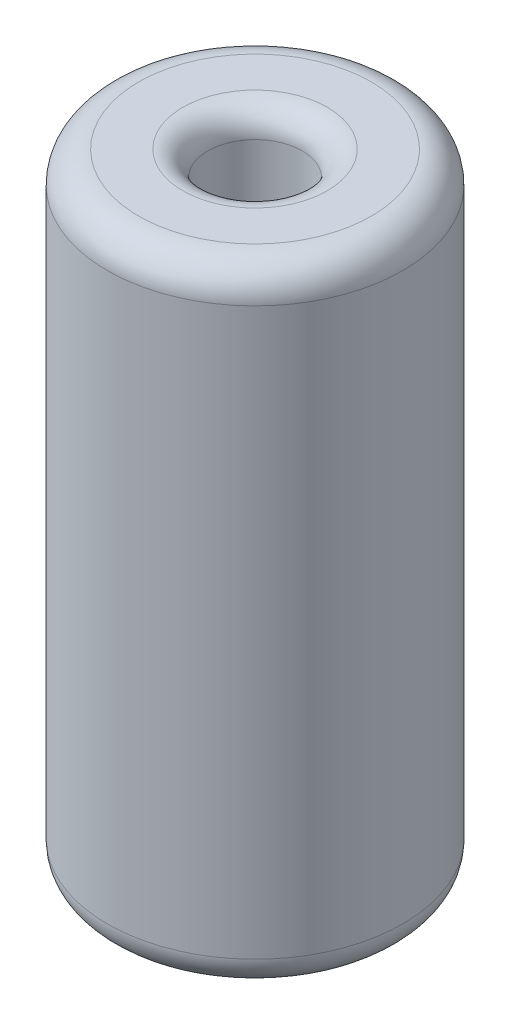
ISO-10303-21;
HEADER;
FILE_DESCRIPTION(('STEP AP214'),'2;1');
FILE_NAME('part.step','',(''),(''),'','','');
FILE_SCHEMA(('AUTOMOTIVE_DESIGN { 1 0 10303 214 1 1 1 1 }'));
ENDSEC;
DATA;
#1=APPLICATION_CONTEXT('core data for automotive mechanical design processes');
#2=APPLICATION_PROTOCOL_DEFINITION('international standard','automotive_design',2000,#1);
#3=PRODUCT_CONTEXT('',#1,'mechanical');
#4=PRODUCT('Part','Part','',(#3));
#5=PRODUCT_RELATED_PRODUCT_CATEGORY('part','',(#4));
#6=PRODUCT_DEFINITION_FORMATION('','',#4);
#7=PRODUCT_DEFINITION_CONTEXT('part definition',#1,'design');
#8=PRODUCT_DEFINITION('design','',#6,#7);
#9=PRODUCT_DEFINITION_SHAPE('','',#8);
#10=(LENGTH_UNIT() NAMED_UNIT(*) SI_UNIT(.MILLI.,.METRE.));
#11=(NAMED_UNIT(*) PLANE_ANGLE_UNIT() SI_UNIT($,.RADIAN.));
#12=(NAMED_UNIT(*) SI_UNIT($,.STERADIAN.) SOLID_ANGLE_UNIT());
#13=UNCERTAINTY_MEASURE_WITH_UNIT(LENGTH_MEASURE(1.E-05),#10,'distance_accuracy_value','');
#14=(GEOMETRIC_REPRESENTATION_CONTEXT(3) GLOBAL_UNCERTAINTY_ASSIGNED_CONTEXT((#13)) GLOBAL_UNIT_ASSIGNED_CONTEXT((#10,
#11,#12)) REPRESENTATION_CONTEXT('',''));
#15=CARTESIAN_POINT('',(0.,0.,0.));
#16=DIRECTION('',(0.,0.,1.));
#17=DIRECTION('',(1.,0.,0.));
#18=AXIS2_PLACEMENT_3D('',#15,#16,#17);
#19=CARTESIAN_POINT('',(0.,0.5,0.));
#20=DIRECTION('',(0.,-1.,0.));
#21=DIRECTION('',(0.,0.,-1.));
#22=AXIS2_PLACEMENT_3D('',#19,#20,#21);
#23=TOROIDAL_SURFACE('',#22,1.85,0.5);
#24=CARTESIAN_POINT('',(0.,0.5,0.));
#25=DIRECTION('',(0.,-1.,0.));
#26=DIRECTION('',(0.,0.,-1.));
#27=AXIS2_PLACEMENT_3D('',#24,#25,#26);
#28=CIRCLE('',#27,2.35);
#29=CARTESIAN_POINT('',(0.,0.5,-2.35));
#30=VERTEX_POINT('',#29);
#31=EDGE_CURVE('E10',#30,#30,#28,.T.);
#32=ORIENTED_EDGE('',*,*,#31,.T.);
#33=EDGE_LOOP('',(#32));
#34=FACE_BOUND('',#33,.T.);
#35=CARTESIAN_POINT('',(0.,0.,0.));
#36=DIRECTION('',(0.,-1.,0.));
#37=DIRECTION('',(0.,0.,-1.));
#38=AXIS2_PLACEMENT_3D('',#35,#36,#37);
#39=CIRCLE('',#38,1.85);
#40=CARTESIAN_POINT('',(0.,0.,-1.85));
#41=VERTEX_POINT('',#40);
#42=EDGE_CURVE('E63',#41,#41,#39,.T.);
#43=ORIENTED_EDGE('',*,*,#42,.F.);
#44=EDGE_LOOP('',(#43));
#45=FACE_BOUND('',#44,.T.);
#46=ADVANCED_FACE('F35',(#34,#45),#23,.T.);
#47=CARTESIAN_POINT('',(0.,0.,0.));
#48=DIRECTION('',(0.,-1.,0.));
#49=DIRECTION('',(0.,0.,-1.));
#50=AXIS2_PLACEMENT_3D('',#47,#48,#49);
#51=CYLINDRICAL_SURFACE('',#50,2.35);
#52=CARTESIAN_POINT('',(0.,9.5,0.));
#53=DIRECTION('',(0.,-1.,0.));
#54=DIRECTION('',(0.,0.,-1.));
#55=AXIS2_PLACEMENT_3D('',#52,#53,#54);
#56=CIRCLE('',#55,2.35);
#57=CARTESIAN_POINT('',(0.,9.5,-2.35));
#58=VERTEX_POINT('',#57);
#59=EDGE_CURVE('E41',#58,#58,#56,.T.);
#60=ORIENTED_EDGE('',*,*,#59,.T.);
#61=EDGE_LOOP('',(#60));
#62=FACE_BOUND('',#61,.T.);
#63=ORIENTED_EDGE('',*,*,#31,.F.);
#64=EDGE_LOOP('',(#63));
#65=FACE_BOUND('',#64,.T.);
#66=ADVANCED_FACE('F71',(#62,#65),#51,.T.);
#67=CARTESIAN_POINT('',(0.,9.5,0.));
#68=DIRECTION('',(0.,-1.,0.));
#69=DIRECTION('',(0.,0.,-1.));
#70=AXIS2_PLACEMENT_3D('',#67,#68,#69);
#71=TOROIDAL_SURFACE('',#70,1.85,0.5);
#72=CARTESIAN_POINT('',(0.,10.,0.));
#73=DIRECTION('',(0.,-1.,0.));
#74=DIRECTION('',(0.,0.,-1.));
#75=AXIS2_PLACEMENT_3D('',#72,#73,#74);
#76=CIRCLE('',#75,1.85);
#77=CARTESIAN_POINT('',(0.,10.,-1.85));
#78=VERTEX_POINT('',#77);
#79=EDGE_CURVE('E45',#78,#78,#76,.T.);
#80=ORIENTED_EDGE('',*,*,#79,.T.);
#81=EDGE_LOOP('',(#80));
#82=FACE_BOUND('',#81,.T.);
#83=ORIENTED_EDGE('',*,*,#59,.F.);
#84=EDGE_LOOP('',(#83));
#85=FACE_BOUND('',#84,.T.);
#86=ADVANCED_FACE('F75',(#82,#85),#71,.T.);
#87=CARTESIAN_POINT('',(1.15,10.,0.));
#88=DIRECTION('',(0.,1.,0.));
#89=DIRECTION('',(0.,0.,1.));
#90=AXIS2_PLACEMENT_3D('',#87,#88,#89);
#91=PLANE('',#90);
#92=CARTESIAN_POINT('',(0.,10.,0.));
#93=DIRECTION('',(0.,-1.,0.));
#94=DIRECTION('',(0.,0.,-1.));
#95=AXIS2_PLACEMENT_3D('',#92,#93,#94);
#96=CIRCLE('',#95,1.15);
#97=CARTESIAN_POINT('',(0.,10.,-1.15));
#98=VERTEX_POINT('',#97);
#99=EDGE_CURVE('E49',#98,#98,#96,.T.);
#100=ORIENTED_EDGE('',*,*,#99,.T.);
#101=EDGE_LOOP('',(#100));
#102=FACE_BOUND('',#101,.T.);
#103=ORIENTED_EDGE('',*,*,#79,.F.);
#104=EDGE_LOOP('',(#103));
#105=FACE_BOUND('',#104,.T.);
#106=ADVANCED_FACE('F79',(#102,#105),#91,.T.);
#107=CARTESIAN_POINT('',(0.,9.6,0.));
#108=DIRECTION('',(0.,-1.,0.));
#109=DIRECTION('',(0.,0.,-1.));
#110=AXIS2_PLACEMENT_3D('',#107,#108,#109);
#111=TOROIDAL_SURFACE('',#110,1.15,0.4);
#112=CARTESIAN_POINT('',(0.,9.6,0.));
#113=DIRECTION('',(0.,-1.,0.));
#114=DIRECTION('',(0.,0.,-1.));
#115=AXIS2_PLACEMENT_3D('',#112,#113,#114);
#116=CIRCLE('',#115,0.749999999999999);
#117=CARTESIAN_POINT('',(0.,9.6,-0.749999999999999));
#118=VERTEX_POINT('',#117);
#119=EDGE_CURVE('E54',#118,#118,#116,.T.);
#120=ORIENTED_EDGE('',*,*,#119,.T.);
#121=EDGE_LOOP('',(#120));
#122=FACE_BOUND('',#121,.T.);
#123=ORIENTED_EDGE('',*,*,#99,.F.);
#124=EDGE_LOOP('',(#123));
#125=FACE_BOUND('',#124,.T.);
#126=ADVANCED_FACE('F86',(#122,#125),#111,.T.);
#127=CARTESIAN_POINT('',(0.,0.,0.));
#128=DIRECTION('',(0.,-1.,0.));
#129=DIRECTION('',(0.,0.,-1.));
#130=AXIS2_PLACEMENT_3D('',#127,#128,#129);
#131=CYLINDRICAL_SURFACE('',#130,0.75);
#132=CARTESIAN_POINT('',(0.,0.4,0.));
#133=DIRECTION('',(0.,-1.,0.));
#134=DIRECTION('',(0.,0.,-1.));
#135=AXIS2_PLACEMENT_3D('',#132,#133,#134);
#136=CIRCLE('',#135,0.75);
#137=CARTESIAN_POINT('',(0.,0.4,-0.75));
#138=VERTEX_POINT('',#137);
#139=EDGE_CURVE('E57',#138,#138,#136,.T.);
#140=ORIENTED_EDGE('',*,*,#139,.T.);
#141=EDGE_LOOP('',(#140));
#142=FACE_BOUND('',#141,.T.);
#143=ORIENTED_EDGE('',*,*,#119,.F.);
#144=EDGE_LOOP('',(#143));
#145=FACE_BOUND('',#144,.T.);
#146=ADVANCED_FACE('F90',(#142,#145),#131,.F.);
#147=CARTESIAN_POINT('',(0.,0.4,0.));
#148=DIRECTION('',(0.,-1.,0.));
#149=DIRECTION('',(0.,0.,-1.));
#150=AXIS2_PLACEMENT_3D('',#147,#148,#149);
#151=TOROIDAL_SURFACE('',#150,1.15,0.4);
#152=CARTESIAN_POINT('',(0.,0.,0.));
#153=DIRECTION('',(0.,-1.,0.));
#154=DIRECTION('',(0.,0.,-1.));
#155=AXIS2_PLACEMENT_3D('',#152,#153,#154);
#156=CIRCLE('',#155,1.15);
#157=CARTESIAN_POINT('',(0.,0.,-1.15));
#158=VERTEX_POINT('',#157);
#159=EDGE_CURVE('E60',#158,#158,#156,.T.);
#160=ORIENTED_EDGE('',*,*,#159,.T.);
#161=EDGE_LOOP('',(#160));
#162=FACE_BOUND('',#161,.T.);
#163=ORIENTED_EDGE('',*,*,#139,.F.);
#164=EDGE_LOOP('',(#163));
#165=FACE_BOUND('',#164,.T.);
#166=ADVANCED_FACE('F94',(#162,#165),#151,.T.);
#167=CARTESIAN_POINT('',(1.15,0.,0.));
#168=DIRECTION('',(0.,-1.,0.));
#169=DIRECTION('',(0.,0.,-1.));
#170=AXIS2_PLACEMENT_3D('',#167,#168,#169);
#171=PLANE('',#170);
#172=ORIENTED_EDGE('',*,*,#42,.T.);
#173=EDGE_LOOP('',(#172));
#174=FACE_BOUND('',#173,.T.);
#175=ORIENTED_EDGE('',*,*,#159,.F.);
#176=EDGE_LOOP('',(#175));
#177=FACE_BOUND('',#176,.T.);
#178=ADVANCED_FACE('F67',(#174,#177),#171,.T.);
#179=CLOSED_SHELL('',(#46,#66,#86,#106,#126,#146,#166,#178));
#180=MANIFOLD_SOLID_BREP('B2',#179);
#181=ADVANCED_BREP_SHAPE_REPRESENTATION('',(#18,#180),#14);
#182=SHAPE_DEFINITION_REPRESENTATION(#9,#181);
ENDSEC;
END-ISO-10303-21;
